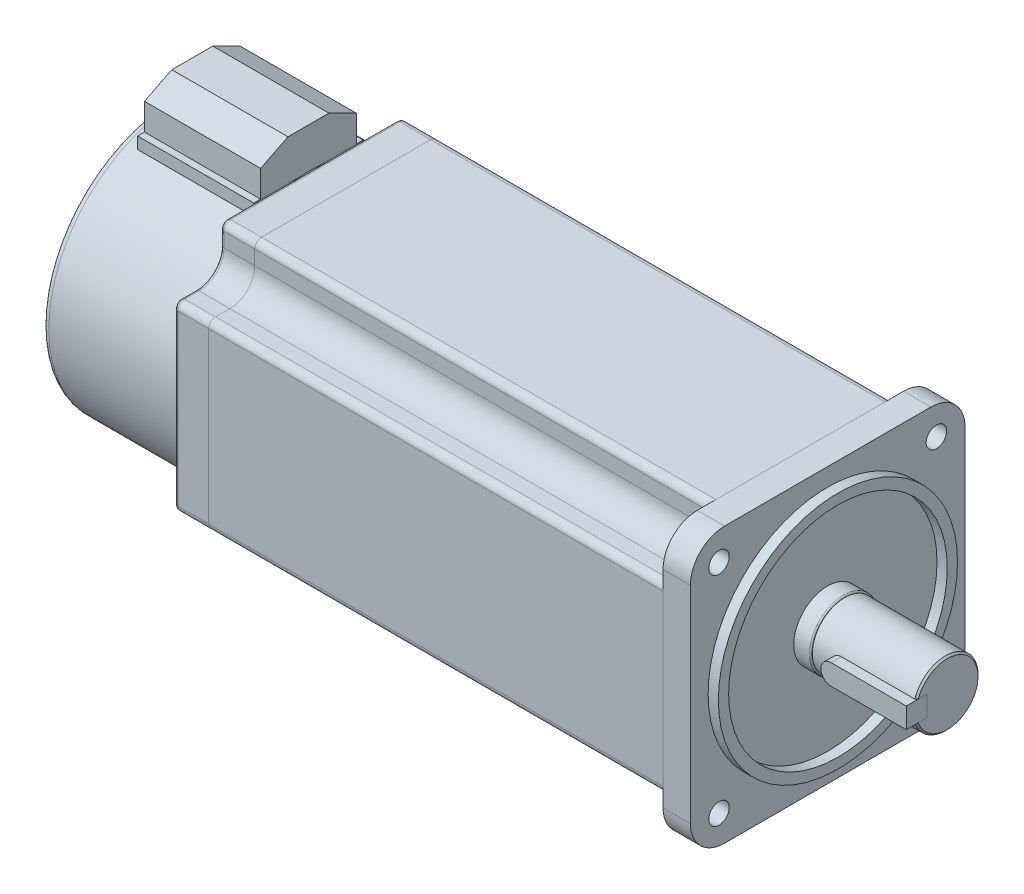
from build123d import *

# Parameters (mm, degrees)
EXTRUDE_1_DEPTH     = 8
EXTRUDE_2_DEPTH     = 133
EXTRUDE_3_DEPTH     = 10
CUT_EXTRUDE_1_DEPTH = 143
FILLET_1_R          = 1
SKETCH_5_R          = 3
CUT_EXTRUDE_2_DEPTH = 8
SKETCH_6_R          = 35
SKETCH_6_R_2        = 32
EXTRUDE_4_DEPTH     = 3
SKETCH_7_R          = 9.95
EXTRUDE_5_DEPTH     = 5
FILLET_2_R          = 0.4
SKETCH_8_R          = 9.5
EXTRUDE_6_DEPTH     = 30
CUT_EXTRUDE_3_DEPTH = 3.5
EXTRUDE_7_DEPTH     = 6
CHAMFER_1_SIZE      = 0.5
SKETCH_11_R         = 39
EXTRUDE_8_DEPTH     = 40
FILLET_3_R          = 2
SKETCH_12_W         = 34
SKETCH_12_H         = 32
CUT_EXTRUDE_4_DEPTH = 5
SKETCH_13_W         = 34
SKETCH_13_H         = 32
EXTRUDE_9_DEPTH     = 5
SKETCH_14_W         = 34
SKETCH_14_H         = 28
EXTRUDE_10_DEPTH    = 11.8
CUT_EXTRUDE_5_DEPTH = 34


with BuildPart() as part:
    # Sketch 1 → Extrude 1 (new body)
    with BuildSketch(Plane(origin=(0, 0, 0), x_dir=(0, 0, -1), z_dir=(1, 0, 0))):
        with BuildLine():
            Line((-30.2, -40.2), (30.2, -40.2))
            ThreePointArc((30.2, -40.2), (37.271067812, -37.271067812), (40.2, -30.2))
            Line((40.2, -30.2), (40.2, 30.2))
            ThreePointArc((40.2, 30.2), (37.271067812, 37.271067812), (30.2, 40.2))
            Line((30.2, 40.2), (-30.2, 40.2))
            ThreePointArc((-30.2, 40.2), (-37.271067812, 37.271067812), (-40.2, 30.2))
            Line((-40.2, 30.2), (-40.2, -30.2))
            ThreePointArc((-40.2, -30.2), (-37.271067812, -37.271067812), (-30.2, -40.2))
        make_face()
    extrude(amount=EXTRUDE_1_DEPTH)

    # Sketch 5 → Cut-Extrude 2 (cut)
    with BuildSketch(Plane(origin=(8, 0, 0), x_dir=(0, 0, -1), z_dir=(1, 0, 0))):
        with Locations((-31.819805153, 31.819805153)):
            Circle(SKETCH_5_R)
        with Locations((31.819805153, 31.819805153)):
            Circle(SKETCH_5_R)
        with Locations((-31.819805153, -31.819805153)):
            Circle(SKETCH_5_R)
        with Locations((31.819805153, -31.819805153)):
            Circle(SKETCH_5_R)
    extrude(amount=-CUT_EXTRUDE_2_DEPTH, mode=Mode.SUBTRACT)

    # Sketch 6 → Extrude 4 (add)
    with BuildSketch(Plane(origin=(8, 0, 0), x_dir=(0, 0, -1), z_dir=(1, 0, 0))):
        Circle(SKETCH_6_R)
        Circle(SKETCH_6_R_2, mode=Mode.SUBTRACT)
    extrude(amount=EXTRUDE_4_DEPTH)

    # Sketch 7 → Extrude 5 (add)
    with BuildSketch(Plane(origin=(8, 0, 0), x_dir=(0, 0, -1), z_dir=(1, 0, 0))):
        Circle(SKETCH_7_R)
    extrude(amount=EXTRUDE_5_DEPTH)

    # Fillet 2
    fillet_2_edges = [part.edges().sort_by_distance(p)[0] for p in [
        (13, 0, 9.95),
    ]]
    fillet(fillet_2_edges, radius=FILLET_2_R)


with BuildPart() as body_2:
    # Sketch 2 → Extrude 2 (new body)
    with BuildSketch(Plane.ZY):
        with BuildLine():
            Line((-30.2, -40.2), (30.2, -40.2))
            ThreePointArc((30.2, -40.2), (37.271067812, -37.271067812), (40.2, -30.2))
            Line((40.2, -30.2), (40.2, 30.2))
            ThreePointArc((40.2, 30.2), (37.271067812, 37.271067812), (30.2, 40.2))
            Line((30.2, 40.2), (-30.2, 40.2))
            ThreePointArc((-30.2, 40.2), (-37.271067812, 37.271067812), (-40.2, 30.2))
            Line((-40.2, 30.2), (-40.2, -30.2))
            ThreePointArc((-40.2, -30.2), (-37.271067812, -37.271067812), (-30.2, -40.2))
        make_face()
    extrude(amount=EXTRUDE_2_DEPTH)


with BuildPart() as body_3:
    # Sketch 3 → Extrude 3 (new body)
    with BuildSketch(Plane.ZY.offset(133)):
        with BuildLine():
            Line((-30.2, -40.2), (30.2, -40.2))
            ThreePointArc((30.2, -40.2), (37.271067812, -37.271067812), (40.2, -30.2))
            Line((40.2, -30.2), (40.2, 30.2))
            ThreePointArc((40.2, 30.2), (37.271067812, 37.271067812), (30.2, 40.2))
            Line((30.2, 40.2), (-30.2, 40.2))
            ThreePointArc((-30.2, 40.2), (-37.271067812, 37.271067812), (-40.2, 30.2))
            Line((-40.2, 30.2), (-40.2, -30.2))
            ThreePointArc((-40.2, -30.2), (-37.271067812, -37.271067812), (-30.2, -40.2))
        make_face()
    extrude(amount=EXTRUDE_3_DEPTH)


with BuildPart() as cut_extrude_1_tool:
    # Sketch 4 → Cut-Extrude 1 (new body)
    with BuildSketch(Plane.ZY.offset(143)):
        with BuildLine():
            Line((-34, -26.728136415), (-38.2, -26.728136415))
            ThreePointArc((-38.2, -26.728136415), (-39.614213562, -26.142349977), (-40.2, -24.728136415))
            Line((-40.2, -24.728136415), (-40.2, -30.2))
            ThreePointArc((-40.2, -30.2), (-37.271067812, -37.271067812), (-30.2, -40.2))
            Line((-30.2, -40.2), (-24.728136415, -40.2))
            ThreePointArc((-24.728136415, -40.2), (-26.142349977, -39.614213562), (-26.728136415, -38.2))
            Line((-26.728136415, -38.2), (-26.728136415, -34))
            ThreePointArc((-26.728136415, -34), (-28.858015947, -28.858015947), (-34, -26.728136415))
        make_face()
        with BuildLine():
            Line((-40.2, 24.728136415), (-40.2, 30.2))
            ThreePointArc((-40.2, 30.2), (-37.271067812, 37.271067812), (-30.2, 40.2))
            Line((-30.2, 40.2), (-24.728136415, 40.2))
            ThreePointArc((-24.728136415, 40.2), (-26.142349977, 39.614213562), (-26.728136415, 38.2))
            Line((-26.728136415, 38.2), (-26.728136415, 34))
            ThreePointArc((-26.728136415, 34), (-28.858015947, 28.858015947), (-34, 26.728136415))
            Line((-34, 26.728136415), (-38.2, 26.728136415))
            ThreePointArc((-38.2, 26.728136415), (-39.614213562, 26.142349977), (-40.2, 24.728136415))
        make_face()
        with BuildLine():
            Line((24.728136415, 40.2), (30.2, 40.2))
            ThreePointArc((30.2, 40.2), (37.271067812, 37.271067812), (40.2, 30.2))
            Line((40.2, 30.2), (40.2, 24.728136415))
            ThreePointArc((40.2, 24.728136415), (39.614213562, 26.142349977), (38.2, 26.728136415))
            Line((38.2, 26.728136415), (34, 26.728136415))
            ThreePointArc((34, 26.728136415), (28.858015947, 28.858015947), (26.728136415, 34))
            Line((26.728136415, 34), (26.728136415, 38.2))
            ThreePointArc((26.728136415, 38.2), (26.142349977, 39.614213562), (24.728136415, 40.2))
        make_face()
        with BuildLine():
            Line((40.2, -24.728136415), (40.2, -30.2))
            ThreePointArc((40.2, -30.2), (37.271067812, -37.271067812), (30.2, -40.2))
            Line((30.2, -40.2), (24.728136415, -40.2))
            ThreePointArc((24.728136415, -40.2), (26.142349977, -39.614213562), (26.728136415, -38.2))
            Line((26.728136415, -38.2), (26.728136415, -34))
            ThreePointArc((26.728136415, -34), (28.858015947, -28.858015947), (34, -26.728136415))
            Line((34, -26.728136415), (38.2, -26.728136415))
            ThreePointArc((38.2, -26.728136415), (39.614213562, -26.142349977), (40.2, -24.728136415))
        make_face()
    extrude(amount=-CUT_EXTRUDE_1_DEPTH)


with BuildPart() as body_2_1:
    add(body_2.part)

    # Cut-Extrude 1: cut by cut_extrude_1_tool
    add(cut_extrude_1_tool.part, mode=Mode.SUBTRACT)


with BuildPart() as body_3_1:
    add(body_3.part)

    # Cut-Extrude 1: cut by cut_extrude_1_tool
    add(cut_extrude_1_tool.part, mode=Mode.SUBTRACT)

    # Fillet 1
    fillet_1_edges = [body_3_1.edges().sort_by_distance(p)[0] for p in [
        (-143, -28.858015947, 28.858015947),
        (-143, -36.1, 26.728136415),
        (-143, -39.614213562, 26.142349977),
        (-143, -26.142349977, 39.614213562),
        (-143, -26.728136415, 36.1),
        (-143, 40.2, 0),
        (-143, 0, -40.2),
        (-143, -40.2, 0),
        (-143, 0, 40.2),
        (-143, -28.858015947, -28.858015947),
        (-143, -26.728136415, -36.1),
        (-143, -26.142349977, -39.614213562),
        (-143, -39.614213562, -26.142349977),
        (-143, -36.1, -26.728136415),
        (-143, 28.858015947, -28.858015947),
        (-143, 36.1, -26.728136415),
        (-143, 39.614213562, -26.142349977),
        (-143, 26.142349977, -39.614213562),
        (-143, 26.728136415, -36.1),
        (-143, 28.858015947, 28.858015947),
        (-143, 26.728136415, 36.1),
        (-143, 26.142349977, 39.614213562),
        (-143, 39.614213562, 26.142349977),
        (-143, 36.1, 26.728136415),
    ]]
    fillet(fillet_1_edges, radius=FILLET_1_R)


with BuildPart() as body_4:
    # Sketch 8 → Extrude 6 (new body)
    with BuildSketch(Plane(origin=(13, 0, 0), x_dir=(0, 0, -1), z_dir=(1, 0, 0))):
        Circle(SKETCH_8_R)
    extrude(amount=EXTRUDE_6_DEPTH)

    # Sketch 9 → Cut-Extrude 3 (cut)
    with BuildSketch(Plane.XY.offset(9.5)):
        with BuildLine():
            Line((21, 3), (43, 3))
            Line((43, 3), (43, -3))
            Line((43, -3), (21, -3))
            ThreePointArc((21, -3), (18, 0), (21, 3))
        make_face()
    extrude(amount=-CUT_EXTRUDE_3_DEPTH, mode=Mode.SUBTRACT)

    # Chamfer 1
    chamfer_1_edges = [body_4.edges().sort_by_distance(p)[0] for p in [
        (43, 9.377682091, -1.519565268),
    ]]
    chamfer(chamfer_1_edges, length=CHAMFER_1_SIZE)


with BuildPart() as body_5:
    # Sketch 10 → Extrude 7 (new body)
    with BuildSketch(Plane.XY.offset(6)):
        with BuildLine():
            Line((21, 3), (43, 3))
            Line((43, 3), (43, -3))
            Line((43, -3), (21, -3))
            ThreePointArc((21, -3), (18, 0), (21, 3))
        make_face()
    extrude(amount=EXTRUDE_7_DEPTH)


with BuildPart() as body_6:
    # Sketch 11 → Extrude 8 (new body)
    with BuildSketch(Plane.ZY.offset(143)):
        Circle(SKETCH_11_R)
    extrude(amount=EXTRUDE_8_DEPTH)

    # Fillet 3
    fillet_3_edges = [body_6.edges().sort_by_distance(p)[0] for p in [
        (-183, 0, -39),
    ]]
    fillet(fillet_3_edges, radius=FILLET_3_R)

    # Sketch 12 → Cut-Extrude 4 (cut)
    with BuildSketch(Plane(origin=(0, 39, 0), x_dir=(1, 0, 0), z_dir=(0, 1, 0))):
        with Locations((-161, 0)):
            Rectangle(SKETCH_12_W, SKETCH_12_H)
    extrude(amount=-CUT_EXTRUDE_4_DEPTH, mode=Mode.SUBTRACT)

    # Sketch 13 → Extrude 9 (add)
    with BuildSketch(Plane(origin=(0, 34, 0), x_dir=(1, 0, 0), z_dir=(0, 1, 0))):
        with Locations((-161, 0)):
            Rectangle(SKETCH_13_W, SKETCH_13_H)
    extrude(amount=EXTRUDE_9_DEPTH)


with BuildPart() as body_7:
    # Sketch 14 → Extrude 10 (new body)
    with BuildSketch(Plane(origin=(0, 39, 0), x_dir=(1, 0, 0), z_dir=(0, 1, 0))):
        with Locations((-161, 0)):
            Rectangle(SKETCH_14_W, SKETCH_14_H)
    extrude(amount=EXTRUDE_10_DEPTH)

    # Sketch 19 → Cut-Extrude 5 (cut)
    with BuildSketch(Plane.ZY.offset(178)):
        Polygon((-14, 50.8), (-14, 46.8), (-6, 50.8), align=None)
        Polygon((14, 50.8), (14, 46.8), (6, 50.8), align=None)
    extrude(amount=-CUT_EXTRUDE_5_DEPTH, mode=Mode.SUBTRACT)


solid = Compound([part.part, body_2_1.part, body_3_1.part, body_4.part, body_5.part, body_6.part, body_7.part])
